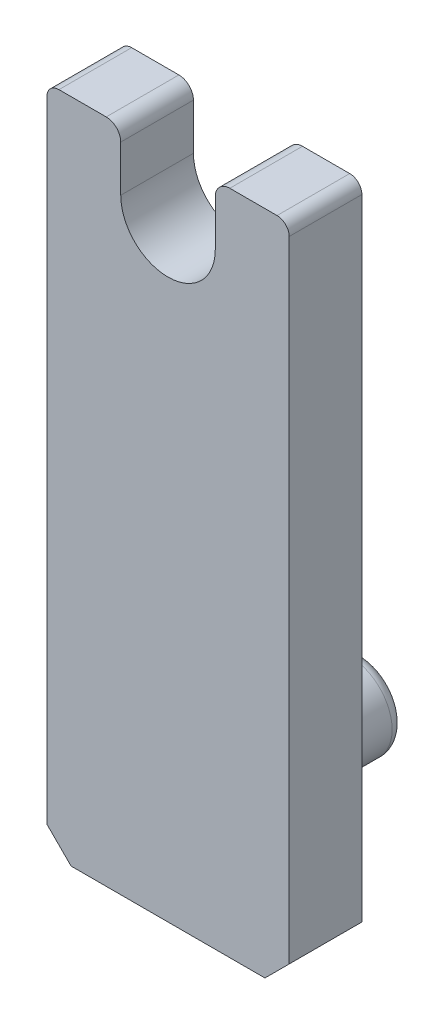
ISO-10303-21;
HEADER;
FILE_DESCRIPTION(('STEP AP214'),'2;1');
FILE_NAME('part.step','',(''),(''),'','','');
FILE_SCHEMA(('AUTOMOTIVE_DESIGN { 1 0 10303 214 1 1 1 1 }'));
ENDSEC;
DATA;
#1=APPLICATION_CONTEXT('core data for automotive mechanical design processes');
#2=APPLICATION_PROTOCOL_DEFINITION('international standard','automotive_design',2000,#1);
#3=PRODUCT_CONTEXT('',#1,'mechanical');
#4=PRODUCT('Part','Part','',(#3));
#5=PRODUCT_RELATED_PRODUCT_CATEGORY('part','',(#4));
#6=PRODUCT_DEFINITION_FORMATION('','',#4);
#7=PRODUCT_DEFINITION_CONTEXT('part definition',#1,'design');
#8=PRODUCT_DEFINITION('design','',#6,#7);
#9=PRODUCT_DEFINITION_SHAPE('','',#8);
#10=(LENGTH_UNIT() NAMED_UNIT(*) SI_UNIT(.MILLI.,.METRE.));
#11=(NAMED_UNIT(*) PLANE_ANGLE_UNIT() SI_UNIT($,.RADIAN.));
#12=(NAMED_UNIT(*) SI_UNIT($,.STERADIAN.) SOLID_ANGLE_UNIT());
#13=UNCERTAINTY_MEASURE_WITH_UNIT(LENGTH_MEASURE(1.E-05),#10,'distance_accuracy_value','');
#14=(GEOMETRIC_REPRESENTATION_CONTEXT(3) GLOBAL_UNCERTAINTY_ASSIGNED_CONTEXT((#13)) GLOBAL_UNIT_ASSIGNED_CONTEXT((#10,
#11,#12)) REPRESENTATION_CONTEXT('',''));
#15=CARTESIAN_POINT('',(0.,0.,0.));
#16=DIRECTION('',(0.,0.,1.));
#17=DIRECTION('',(1.,0.,0.));
#18=AXIS2_PLACEMENT_3D('',#15,#16,#17);
#19=CARTESIAN_POINT('',(-38.8182999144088,37.2047435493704,3.));
#20=DIRECTION('',(1.,0.,0.));
#21=DIRECTION('',(0.,0.,-1.));
#22=AXIS2_PLACEMENT_3D('',#19,#20,#21);
#23=PLANE('',#22);
#24=DIRECTION('',(0.,-1.,0.));
#25=VECTOR('',#24,1.);
#26=CARTESIAN_POINT('',(-38.8182999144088,37.2047435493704,0.));
#27=LINE('',#26,#25);
#28=CARTESIAN_POINT('',(-38.8182999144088,36.7047435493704,0.));
#29=VERTEX_POINT('',#28);
#30=CARTESIAN_POINT('',(-38.8182999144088,10.7047435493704,0.));
#31=VERTEX_POINT('',#30);
#32=EDGE_CURVE('E155',#29,#31,#27,.T.);
#33=ORIENTED_EDGE('',*,*,#32,.T.);
#34=DIRECTION('',(0.,0.,1.));
#35=VECTOR('',#34,1.);
#36=CARTESIAN_POINT('',(-38.8182999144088,10.7047435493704,3.));
#37=LINE('',#36,#35);
#38=CARTESIAN_POINT('',(-38.8182999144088,10.7047435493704,3.));
#39=VERTEX_POINT('',#38);
#40=EDGE_CURVE('E31',#31,#39,#37,.T.);
#41=ORIENTED_EDGE('',*,*,#40,.T.);
#42=DIRECTION('',(0.,-1.,0.));
#43=VECTOR('',#42,1.);
#44=CARTESIAN_POINT('',(-38.8182999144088,37.2047435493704,3.));
#45=LINE('',#44,#43);
#46=CARTESIAN_POINT('',(-38.8182999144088,36.7047435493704,3.));
#47=VERTEX_POINT('',#46);
#48=EDGE_CURVE('E172',#47,#39,#45,.T.);
#49=ORIENTED_EDGE('',*,*,#48,.F.);
#50=DIRECTION('',(0.,0.,-1.));
#51=VECTOR('',#50,1.);
#52=CARTESIAN_POINT('',(-38.8182999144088,36.7047435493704,3.));
#53=LINE('',#52,#51);
#54=EDGE_CURVE('E206',#47,#29,#53,.T.);
#55=ORIENTED_EDGE('',*,*,#54,.T.);
#56=EDGE_LOOP('',(#33,#41,#49,#55));
#57=FACE_BOUND('',#56,.T.);
#58=ADVANCED_FACE('F16',(#57),#23,.F.);
#59=CARTESIAN_POINT('',(-38.8182999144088,9.70474354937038,3.));
#60=DIRECTION('',(0.,1.,0.));
#61=DIRECTION('',(0.,0.,1.));
#62=AXIS2_PLACEMENT_3D('',#59,#60,#61);
#63=PLANE('',#62);
#64=DIRECTION('',(1.,0.,0.));
#65=VECTOR('',#64,1.);
#66=CARTESIAN_POINT('',(-38.8182999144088,9.70474354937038,0.));
#67=LINE('',#66,#65);
#68=CARTESIAN_POINT('',(-37.8182999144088,9.70474354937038,0.));
#69=VERTEX_POINT('',#68);
#70=CARTESIAN_POINT('',(-29.8182999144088,9.70474354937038,0.));
#71=VERTEX_POINT('',#70);
#72=EDGE_CURVE('E157',#69,#71,#67,.T.);
#73=ORIENTED_EDGE('',*,*,#72,.T.);
#74=DIRECTION('',(0.,0.,1.));
#75=VECTOR('',#74,1.);
#76=CARTESIAN_POINT('',(-29.8182999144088,9.70474354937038,3.));
#77=LINE('',#76,#75);
#78=CARTESIAN_POINT('',(-29.8182999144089,9.70474354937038,3.));
#79=VERTEX_POINT('',#78);
#80=EDGE_CURVE('E39',#71,#79,#77,.T.);
#81=ORIENTED_EDGE('',*,*,#80,.T.);
#82=DIRECTION('',(1.,0.,0.));
#83=VECTOR('',#82,1.);
#84=CARTESIAN_POINT('',(-38.8182999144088,9.70474354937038,3.));
#85=LINE('',#84,#83);
#86=CARTESIAN_POINT('',(-37.8182999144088,9.70474354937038,3.));
#87=VERTEX_POINT('',#86);
#88=EDGE_CURVE('E285',#87,#79,#85,.T.);
#89=ORIENTED_EDGE('',*,*,#88,.F.);
#90=DIRECTION('',(0.,0.,-1.));
#91=VECTOR('',#90,1.);
#92=CARTESIAN_POINT('',(-37.8182999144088,9.70474354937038,3.));
#93=LINE('',#92,#91);
#94=EDGE_CURVE('E221',#87,#69,#93,.T.);
#95=ORIENTED_EDGE('',*,*,#94,.T.);
#96=EDGE_LOOP('',(#73,#81,#89,#95));
#97=FACE_BOUND('',#96,.T.);
#98=ADVANCED_FACE('F246',(#97),#63,.F.);
#99=CARTESIAN_POINT('',(-28.8182999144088,37.2047435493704,3.));
#100=DIRECTION('',(-1.,0.,0.));
#101=DIRECTION('',(0.,0.,1.));
#102=AXIS2_PLACEMENT_3D('',#99,#100,#101);
#103=PLANE('',#102);
#104=DIRECTION('',(0.,1.,0.));
#105=VECTOR('',#104,1.);
#106=CARTESIAN_POINT('',(-28.8182999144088,37.2047435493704,3.));
#107=LINE('',#106,#105);
#108=CARTESIAN_POINT('',(-28.8182999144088,10.7047435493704,3.));
#109=VERTEX_POINT('',#108);
#110=CARTESIAN_POINT('',(-28.8182999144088,36.7047435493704,3.));
#111=VERTEX_POINT('',#110);
#112=EDGE_CURVE('E284',#109,#111,#107,.T.);
#113=ORIENTED_EDGE('',*,*,#112,.F.);
#114=DIRECTION('',(0.,0.,-1.));
#115=VECTOR('',#114,1.);
#116=CARTESIAN_POINT('',(-28.8182999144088,10.7047435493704,3.));
#117=LINE('',#116,#115);
#118=CARTESIAN_POINT('',(-28.8182999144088,10.7047435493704,0.));
#119=VERTEX_POINT('',#118);
#120=EDGE_CURVE('E214',#109,#119,#117,.T.);
#121=ORIENTED_EDGE('',*,*,#120,.T.);
#122=DIRECTION('',(0.,1.,0.));
#123=VECTOR('',#122,1.);
#124=CARTESIAN_POINT('',(-28.8182999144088,37.2047435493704,0.));
#125=LINE('',#124,#123);
#126=CARTESIAN_POINT('',(-28.8182999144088,36.7047435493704,0.));
#127=VERTEX_POINT('',#126);
#128=EDGE_CURVE('E159',#119,#127,#125,.T.);
#129=ORIENTED_EDGE('',*,*,#128,.T.);
#130=DIRECTION('',(0.,0.,-1.));
#131=VECTOR('',#130,1.);
#132=CARTESIAN_POINT('',(-28.8182999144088,36.7047435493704,3.));
#133=LINE('',#132,#131);
#134=EDGE_CURVE('E199',#127,#111,#133,.F.);
#135=ORIENTED_EDGE('',*,*,#134,.T.);
#136=EDGE_LOOP('',(#113,#121,#129,#135));
#137=FACE_BOUND('',#136,.T.);
#138=ADVANCED_FACE('F252',(#137),#103,.F.);
#139=CARTESIAN_POINT('',(-31.8682999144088,37.2047435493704,3.));
#140=DIRECTION('',(0.,-1.,0.));
#141=DIRECTION('',(0.,0.,-1.));
#142=AXIS2_PLACEMENT_3D('',#139,#140,#141);
#143=PLANE('',#142);
#144=DIRECTION('',(-1.,0.,0.));
#145=VECTOR('',#144,1.);
#146=CARTESIAN_POINT('',(-31.8682999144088,37.2047435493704,3.));
#147=LINE('',#146,#145);
#148=CARTESIAN_POINT('',(-29.3182999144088,37.2047435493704,3.));
#149=VERTEX_POINT('',#148);
#150=CARTESIAN_POINT('',(-31.2682999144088,37.2047435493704,3.));
#151=VERTEX_POINT('',#150);
#152=EDGE_CURVE('E132',#149,#151,#147,.T.);
#153=ORIENTED_EDGE('',*,*,#152,.F.);
#154=DIRECTION('',(0.,0.,-1.));
#155=VECTOR('',#154,1.);
#156=CARTESIAN_POINT('',(-29.3182999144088,37.2047435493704,3.));
#157=LINE('',#156,#155);
#158=CARTESIAN_POINT('',(-29.3182999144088,37.2047435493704,0.));
#159=VERTEX_POINT('',#158);
#160=EDGE_CURVE('E191',#149,#159,#157,.T.);
#161=ORIENTED_EDGE('',*,*,#160,.T.);
#162=DIRECTION('',(-1.,0.,0.));
#163=VECTOR('',#162,1.);
#164=CARTESIAN_POINT('',(-31.8682999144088,37.2047435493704,0.));
#165=LINE('',#164,#163);
#166=CARTESIAN_POINT('',(-31.2682999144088,37.2047435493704,0.));
#167=VERTEX_POINT('',#166);
#168=EDGE_CURVE('E161',#159,#167,#165,.T.);
#169=ORIENTED_EDGE('',*,*,#168,.T.);
#170=DIRECTION('',(0.,0.,-1.));
#171=VECTOR('',#170,1.);
#172=CARTESIAN_POINT('',(-31.2682999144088,37.2047435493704,3.));
#173=LINE('',#172,#171);
#174=EDGE_CURVE('E180',#167,#151,#173,.F.);
#175=ORIENTED_EDGE('',*,*,#174,.T.);
#176=EDGE_LOOP('',(#153,#161,#169,#175));
#177=FACE_BOUND('',#176,.T.);
#178=ADVANCED_FACE('F304',(#177),#143,.F.);
#179=CARTESIAN_POINT('',(-31.8682999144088,34.7047435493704,3.));
#180=DIRECTION('',(1.,0.,0.));
#181=DIRECTION('',(0.,0.,-1.));
#182=AXIS2_PLACEMENT_3D('',#179,#180,#181);
#183=PLANE('',#182);
#184=DIRECTION('',(0.,-1.,0.));
#185=VECTOR('',#184,1.);
#186=CARTESIAN_POINT('',(-31.8682999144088,34.7047435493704,3.));
#187=LINE('',#186,#185);
#188=CARTESIAN_POINT('',(-31.8682999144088,36.6047435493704,3.));
#189=VERTEX_POINT('',#188);
#190=CARTESIAN_POINT('',(-31.8682999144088,34.7047435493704,3.));
#191=VERTEX_POINT('',#190);
#192=EDGE_CURVE('E120',#189,#191,#187,.T.);
#193=ORIENTED_EDGE('',*,*,#192,.F.);
#194=DIRECTION('',(0.,0.,-1.));
#195=VECTOR('',#194,1.);
#196=CARTESIAN_POINT('',(-31.8682999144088,36.6047435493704,3.));
#197=LINE('',#196,#195);
#198=CARTESIAN_POINT('',(-31.8682999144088,36.6047435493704,0.));
#199=VERTEX_POINT('',#198);
#200=EDGE_CURVE('E141',#189,#199,#197,.T.);
#201=ORIENTED_EDGE('',*,*,#200,.T.);
#202=DIRECTION('',(0.,-1.,0.));
#203=VECTOR('',#202,1.);
#204=CARTESIAN_POINT('',(-31.8682999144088,34.7047435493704,0.));
#205=LINE('',#204,#203);
#206=CARTESIAN_POINT('',(-31.8682999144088,34.7047435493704,0.));
#207=VERTEX_POINT('',#206);
#208=EDGE_CURVE('E138',#199,#207,#205,.T.);
#209=ORIENTED_EDGE('',*,*,#208,.T.);
#210=DIRECTION('',(0.,0.,-1.));
#211=VECTOR('',#210,1.);
#212=CARTESIAN_POINT('',(-31.8682999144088,34.7047435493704,3.));
#213=LINE('',#212,#211);
#214=EDGE_CURVE('E135',#191,#207,#213,.T.);
#215=ORIENTED_EDGE('',*,*,#214,.F.);
#216=EDGE_LOOP('',(#193,#201,#209,#215));
#217=FACE_BOUND('',#216,.T.);
#218=ADVANCED_FACE('F136',(#217),#183,.F.);
#219=CARTESIAN_POINT('',(-33.8182999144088,34.7047435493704,3.));
#220=DIRECTION('',(0.,0.,-1.));
#221=DIRECTION('',(-1.,0.,0.));
#222=AXIS2_PLACEMENT_3D('',#219,#220,#221);
#223=CYLINDRICAL_SURFACE('',#222,1.95);
#224=CARTESIAN_POINT('',(-33.8182999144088,34.7047435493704,0.));
#225=DIRECTION('',(0.,0.,-1.));
#226=DIRECTION('',(1.,0.,0.));
#227=AXIS2_PLACEMENT_3D('',#224,#225,#226);
#228=CIRCLE('',#227,1.95);
#229=CARTESIAN_POINT('',(-35.7682999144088,34.7047435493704,0.));
#230=VERTEX_POINT('',#229);
#231=EDGE_CURVE('E164',#207,#230,#228,.T.);
#232=ORIENTED_EDGE('',*,*,#231,.T.);
#233=DIRECTION('',(0.,0.,-1.));
#234=VECTOR('',#233,1.);
#235=CARTESIAN_POINT('',(-35.7682999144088,34.7047435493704,3.));
#236=LINE('',#235,#234);
#237=CARTESIAN_POINT('',(-35.7682999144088,34.7047435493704,3.));
#238=VERTEX_POINT('',#237);
#239=EDGE_CURVE('E142',#238,#230,#236,.T.);
#240=ORIENTED_EDGE('',*,*,#239,.F.);
#241=CARTESIAN_POINT('',(-33.8182999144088,34.7047435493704,3.));
#242=DIRECTION('',(0.,0.,-1.));
#243=DIRECTION('',(1.,0.,0.));
#244=AXIS2_PLACEMENT_3D('',#241,#242,#243);
#245=CIRCLE('',#244,1.95);
#246=EDGE_CURVE('E125',#191,#238,#245,.T.);
#247=ORIENTED_EDGE('',*,*,#246,.F.);
#248=ORIENTED_EDGE('',*,*,#214,.T.);
#249=EDGE_LOOP('',(#232,#240,#247,#248));
#250=FACE_BOUND('',#249,.T.);
#251=ADVANCED_FACE('F144',(#250),#223,.F.);
#252=CARTESIAN_POINT('',(-35.7682999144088,34.7047435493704,3.));
#253=DIRECTION('',(-1.,0.,0.));
#254=DIRECTION('',(0.,0.,1.));
#255=AXIS2_PLACEMENT_3D('',#252,#253,#254);
#256=PLANE('',#255);
#257=DIRECTION('',(0.,1.,0.));
#258=VECTOR('',#257,1.);
#259=CARTESIAN_POINT('',(-35.7682999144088,34.7047435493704,0.));
#260=LINE('',#259,#258);
#261=CARTESIAN_POINT('',(-35.7682999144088,36.6047435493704,0.));
#262=VERTEX_POINT('',#261);
#263=EDGE_CURVE('E166',#230,#262,#260,.T.);
#264=ORIENTED_EDGE('',*,*,#263,.T.);
#265=DIRECTION('',(0.,0.,-1.));
#266=VECTOR('',#265,1.);
#267=CARTESIAN_POINT('',(-35.7682999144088,36.6047435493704,3.));
#268=LINE('',#267,#266);
#269=CARTESIAN_POINT('',(-35.7682999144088,36.6047435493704,3.));
#270=VERTEX_POINT('',#269);
#271=EDGE_CURVE('E189',#262,#270,#268,.F.);
#272=ORIENTED_EDGE('',*,*,#271,.T.);
#273=DIRECTION('',(0.,1.,0.));
#274=VECTOR('',#273,1.);
#275=CARTESIAN_POINT('',(-35.7682999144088,34.7047435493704,3.));
#276=LINE('',#275,#274);
#277=EDGE_CURVE('E147',#238,#270,#276,.T.);
#278=ORIENTED_EDGE('',*,*,#277,.F.);
#279=ORIENTED_EDGE('',*,*,#239,.T.);
#280=EDGE_LOOP('',(#264,#272,#278,#279));
#281=FACE_BOUND('',#280,.T.);
#282=ADVANCED_FACE('F308',(#281),#256,.F.);
#283=CARTESIAN_POINT('',(-38.8182999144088,37.2047435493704,3.));
#284=DIRECTION('',(0.,-1.,0.));
#285=DIRECTION('',(0.,0.,-1.));
#286=AXIS2_PLACEMENT_3D('',#283,#284,#285);
#287=PLANE('',#286);
#288=DIRECTION('',(-1.,0.,0.));
#289=VECTOR('',#288,1.);
#290=CARTESIAN_POINT('',(-38.8182999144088,37.2047435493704,0.));
#291=LINE('',#290,#289);
#292=CARTESIAN_POINT('',(-36.3682999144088,37.2047435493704,0.));
#293=VERTEX_POINT('',#292);
#294=CARTESIAN_POINT('',(-38.3182999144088,37.2047435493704,0.));
#295=VERTEX_POINT('',#294);
#296=EDGE_CURVE('E169',#293,#295,#291,.T.);
#297=ORIENTED_EDGE('',*,*,#296,.T.);
#298=DIRECTION('',(0.,0.,-1.));
#299=VECTOR('',#298,1.);
#300=CARTESIAN_POINT('',(-38.3182999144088,37.2047435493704,3.));
#301=LINE('',#300,#299);
#302=CARTESIAN_POINT('',(-38.3182999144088,37.2047435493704,3.));
#303=VERTEX_POINT('',#302);
#304=EDGE_CURVE('E209',#295,#303,#301,.F.);
#305=ORIENTED_EDGE('',*,*,#304,.T.);
#306=DIRECTION('',(-1.,0.,0.));
#307=VECTOR('',#306,1.);
#308=CARTESIAN_POINT('',(-38.8182999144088,37.2047435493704,3.));
#309=LINE('',#308,#307);
#310=CARTESIAN_POINT('',(-36.3682999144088,37.2047435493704,3.));
#311=VERTEX_POINT('',#310);
#312=EDGE_CURVE('E149',#311,#303,#309,.T.);
#313=ORIENTED_EDGE('',*,*,#312,.F.);
#314=DIRECTION('',(0.,0.,-1.));
#315=VECTOR('',#314,1.);
#316=CARTESIAN_POINT('',(-36.3682999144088,37.2047435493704,3.));
#317=LINE('',#316,#315);
#318=EDGE_CURVE('E186',#311,#293,#317,.T.);
#319=ORIENTED_EDGE('',*,*,#318,.T.);
#320=EDGE_LOOP('',(#297,#305,#313,#319));
#321=FACE_BOUND('',#320,.T.);
#322=ADVANCED_FACE('F315',(#321),#287,.F.);
#323=CARTESIAN_POINT('',(-33.8182999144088,34.7047435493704,3.));
#324=DIRECTION('',(0.,0.,1.));
#325=DIRECTION('',(1.,0.,0.));
#326=AXIS2_PLACEMENT_3D('',#323,#324,#325);
#327=PLANE('',#326);
#328=ORIENTED_EDGE('',*,*,#88,.T.);
#329=DIRECTION('',(-0.707106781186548,-0.707106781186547,0.));
#330=VECTOR('',#329,1.);
#331=CARTESIAN_POINT('',(-19.3182999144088,20.2047435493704,3.));
#332=LINE('',#331,#330);
#333=EDGE_CURVE('E227',#79,#109,#332,.F.);
#334=ORIENTED_EDGE('',*,*,#333,.T.);
#335=ORIENTED_EDGE('',*,*,#112,.T.);
#336=CARTESIAN_POINT('',(-29.3182999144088,36.7047435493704,3.));
#337=DIRECTION('',(0.,0.,1.));
#338=DIRECTION('',(1.,0.,0.));
#339=AXIS2_PLACEMENT_3D('',#336,#337,#338);
#340=CIRCLE('',#339,0.5);
#341=EDGE_CURVE('E204',#111,#149,#340,.T.);
#342=ORIENTED_EDGE('',*,*,#341,.T.);
#343=ORIENTED_EDGE('',*,*,#152,.T.);
#344=CARTESIAN_POINT('',(-31.2682999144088,36.6047435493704,3.));
#345=DIRECTION('',(0.,0.,1.));
#346=DIRECTION('',(1.,0.,0.));
#347=AXIS2_PLACEMENT_3D('',#344,#345,#346);
#348=CIRCLE('',#347,0.6);
#349=EDGE_CURVE('E128',#151,#189,#348,.T.);
#350=ORIENTED_EDGE('',*,*,#349,.T.);
#351=ORIENTED_EDGE('',*,*,#192,.T.);
#352=ORIENTED_EDGE('',*,*,#246,.T.);
#353=ORIENTED_EDGE('',*,*,#277,.T.);
#354=CARTESIAN_POINT('',(-36.3682999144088,36.6047435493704,3.));
#355=DIRECTION('',(0.,0.,1.));
#356=DIRECTION('',(1.,0.,0.));
#357=AXIS2_PLACEMENT_3D('',#354,#355,#356);
#358=CIRCLE('',#357,0.6);
#359=EDGE_CURVE('E183',#270,#311,#358,.T.);
#360=ORIENTED_EDGE('',*,*,#359,.T.);
#361=ORIENTED_EDGE('',*,*,#312,.T.);
#362=CARTESIAN_POINT('',(-38.3182999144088,36.7047435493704,3.));
#363=DIRECTION('',(0.,0.,1.));
#364=DIRECTION('',(1.,0.,0.));
#365=AXIS2_PLACEMENT_3D('',#362,#363,#364);
#366=CIRCLE('',#365,0.5);
#367=EDGE_CURVE('E202',#303,#47,#366,.T.);
#368=ORIENTED_EDGE('',*,*,#367,.T.);
#369=ORIENTED_EDGE('',*,*,#48,.T.);
#370=DIRECTION('',(-0.707106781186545,0.707106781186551,0.));
#371=VECTOR('',#370,1.);
#372=CARTESIAN_POINT('',(-48.3182999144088,20.2047435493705,3.));
#373=LINE('',#372,#371);
#374=EDGE_CURVE('E225',#39,#87,#373,.F.);
#375=ORIENTED_EDGE('',*,*,#374,.T.);
#376=EDGE_LOOP('',(#328,#334,#335,#342,#343,#350,#351,#352,#353,#360,#361,#368,#369,#375));
#377=FACE_BOUND('',#376,.T.);
#378=ADVANCED_FACE('F122',(#377),#327,.T.);
#379=CARTESIAN_POINT('',(-33.8182999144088,34.7047435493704,0.));
#380=DIRECTION('',(0.,0.,1.));
#381=DIRECTION('',(1.,0.,0.));
#382=AXIS2_PLACEMENT_3D('',#379,#380,#381);
#383=PLANE('',#382);
#384=CARTESIAN_POINT('',(-33.8182999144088,13.7047435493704,0.));
#385=DIRECTION('',(0.,0.,1.));
#386=DIRECTION('',(1.,0.,0.));
#387=AXIS2_PLACEMENT_3D('',#384,#385,#386);
#388=CIRCLE('',#387,1.75);
#389=CARTESIAN_POINT('',(-32.0682999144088,13.7047435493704,0.));
#390=VERTEX_POINT('',#389);
#391=EDGE_CURVE('E211',#390,#390,#388,.F.);
#392=ORIENTED_EDGE('',*,*,#391,.F.);
#393=EDGE_LOOP('',(#392));
#394=FACE_BOUND('',#393,.T.);
#395=ORIENTED_EDGE('',*,*,#128,.F.);
#396=DIRECTION('',(0.707106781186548,0.707106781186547,0.));
#397=VECTOR('',#396,1.);
#398=CARTESIAN_POINT('',(-28.8182999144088,10.7047435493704,0.));
#399=LINE('',#398,#397);
#400=EDGE_CURVE('E219',#119,#71,#399,.F.);
#401=ORIENTED_EDGE('',*,*,#400,.T.);
#402=ORIENTED_EDGE('',*,*,#72,.F.);
#403=DIRECTION('',(0.707106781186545,-0.707106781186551,0.));
#404=VECTOR('',#403,1.);
#405=CARTESIAN_POINT('',(-37.8182999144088,9.70474354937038,0.));
#406=LINE('',#405,#404);
#407=EDGE_CURVE('E217',#69,#31,#406,.F.);
#408=ORIENTED_EDGE('',*,*,#407,.T.);
#409=ORIENTED_EDGE('',*,*,#32,.F.);
#410=CARTESIAN_POINT('',(-38.3182999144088,36.7047435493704,0.));
#411=DIRECTION('',(0.,0.,1.));
#412=DIRECTION('',(1.,0.,0.));
#413=AXIS2_PLACEMENT_3D('',#410,#411,#412);
#414=CIRCLE('',#413,0.5);
#415=EDGE_CURVE('E194',#29,#295,#414,.F.);
#416=ORIENTED_EDGE('',*,*,#415,.T.);
#417=ORIENTED_EDGE('',*,*,#296,.F.);
#418=CARTESIAN_POINT('',(-36.3682999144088,36.6047435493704,0.));
#419=DIRECTION('',(0.,0.,1.));
#420=DIRECTION('',(1.,0.,0.));
#421=AXIS2_PLACEMENT_3D('',#418,#419,#420);
#422=CIRCLE('',#421,0.6);
#423=EDGE_CURVE('E175',#293,#262,#422,.F.);
#424=ORIENTED_EDGE('',*,*,#423,.T.);
#425=ORIENTED_EDGE('',*,*,#263,.F.);
#426=ORIENTED_EDGE('',*,*,#231,.F.);
#427=ORIENTED_EDGE('',*,*,#208,.F.);
#428=CARTESIAN_POINT('',(-31.2682999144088,36.6047435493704,0.));
#429=DIRECTION('',(0.,0.,1.));
#430=DIRECTION('',(1.,0.,0.));
#431=AXIS2_PLACEMENT_3D('',#428,#429,#430);
#432=CIRCLE('',#431,0.6);
#433=EDGE_CURVE('E177',#199,#167,#432,.F.);
#434=ORIENTED_EDGE('',*,*,#433,.T.);
#435=ORIENTED_EDGE('',*,*,#168,.F.);
#436=CARTESIAN_POINT('',(-29.3182999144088,36.7047435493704,0.));
#437=DIRECTION('',(0.,0.,1.));
#438=DIRECTION('',(1.,0.,0.));
#439=AXIS2_PLACEMENT_3D('',#436,#437,#438);
#440=CIRCLE('',#439,0.5);
#441=EDGE_CURVE('E196',#159,#127,#440,.F.);
#442=ORIENTED_EDGE('',*,*,#441,.T.);
#443=EDGE_LOOP('',(#395,#401,#402,#408,#409,#416,#417,#424,#425,#426,#427,#434,#435,#442));
#444=FACE_BOUND('',#443,.T.);
#445=ADVANCED_FACE('F260',(#394,#444),#383,.F.);
#446=CARTESIAN_POINT('',(-31.2682999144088,36.6047435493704,3.));
#447=DIRECTION('',(0.,0.,-1.));
#448=DIRECTION('',(-1.,0.,0.));
#449=AXIS2_PLACEMENT_3D('',#446,#447,#448);
#450=CYLINDRICAL_SURFACE('',#449,0.6);
#451=ORIENTED_EDGE('',*,*,#349,.F.);
#452=ORIENTED_EDGE('',*,*,#174,.F.);
#453=ORIENTED_EDGE('',*,*,#433,.F.);
#454=ORIENTED_EDGE('',*,*,#200,.F.);
#455=EDGE_LOOP('',(#451,#452,#453,#454));
#456=FACE_BOUND('',#455,.T.);
#457=ADVANCED_FACE('F256',(#456),#450,.T.);
#458=CARTESIAN_POINT('',(-36.3682999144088,36.6047435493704,3.));
#459=DIRECTION('',(0.,0.,-1.));
#460=DIRECTION('',(-1.,0.,0.));
#461=AXIS2_PLACEMENT_3D('',#458,#459,#460);
#462=CYLINDRICAL_SURFACE('',#461,0.6);
#463=ORIENTED_EDGE('',*,*,#359,.F.);
#464=ORIENTED_EDGE('',*,*,#271,.F.);
#465=ORIENTED_EDGE('',*,*,#423,.F.);
#466=ORIENTED_EDGE('',*,*,#318,.F.);
#467=EDGE_LOOP('',(#463,#464,#465,#466));
#468=FACE_BOUND('',#467,.T.);
#469=ADVANCED_FACE('F259',(#468),#462,.T.);
#470=CARTESIAN_POINT('',(-29.3182999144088,36.7047435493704,3.));
#471=DIRECTION('',(0.,0.,-1.));
#472=DIRECTION('',(-1.,0.,0.));
#473=AXIS2_PLACEMENT_3D('',#470,#471,#472);
#474=CYLINDRICAL_SURFACE('',#473,0.5);
#475=ORIENTED_EDGE('',*,*,#341,.F.);
#476=ORIENTED_EDGE('',*,*,#134,.F.);
#477=ORIENTED_EDGE('',*,*,#441,.F.);
#478=ORIENTED_EDGE('',*,*,#160,.F.);
#479=EDGE_LOOP('',(#475,#476,#477,#478));
#480=FACE_BOUND('',#479,.T.);
#481=ADVANCED_FACE('F264',(#480),#474,.T.);
#482=CARTESIAN_POINT('',(-38.3182999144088,36.7047435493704,3.));
#483=DIRECTION('',(0.,0.,-1.));
#484=DIRECTION('',(-1.,0.,0.));
#485=AXIS2_PLACEMENT_3D('',#482,#483,#484);
#486=CYLINDRICAL_SURFACE('',#485,0.5);
#487=ORIENTED_EDGE('',*,*,#367,.F.);
#488=ORIENTED_EDGE('',*,*,#304,.F.);
#489=ORIENTED_EDGE('',*,*,#415,.F.);
#490=ORIENTED_EDGE('',*,*,#54,.F.);
#491=EDGE_LOOP('',(#487,#488,#489,#490));
#492=FACE_BOUND('',#491,.T.);
#493=ADVANCED_FACE('F268',(#492),#486,.T.);
#494=CARTESIAN_POINT('',(-33.8182999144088,13.7047435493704,-5.));
#495=DIRECTION('',(0.,0.,1.));
#496=DIRECTION('',(1.,0.,0.));
#497=AXIS2_PLACEMENT_3D('',#494,#495,#496);
#498=CYLINDRICAL_SURFACE('',#497,1.75);
#499=CARTESIAN_POINT('',(-33.8182999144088,13.7047435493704,-4.5));
#500=DIRECTION('',(0.,0.,-1.));
#501=DIRECTION('',(-1.,0.,0.));
#502=AXIS2_PLACEMENT_3D('',#499,#500,#501);
#503=CIRCLE('',#502,1.75);
#504=CARTESIAN_POINT('',(-35.5682999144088,13.7047435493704,-4.5));
#505=VERTEX_POINT('',#504);
#506=EDGE_CURVE('E11',#505,#505,#503,.F.);
#507=ORIENTED_EDGE('',*,*,#506,.T.);
#508=EDGE_LOOP('',(#507));
#509=FACE_BOUND('',#508,.T.);
#510=ORIENTED_EDGE('',*,*,#391,.T.);
#511=EDGE_LOOP('',(#510));
#512=FACE_BOUND('',#511,.T.);
#513=ADVANCED_FACE('F272',(#509,#512),#498,.T.);
#514=CARTESIAN_POINT('',(-33.8182999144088,13.7047435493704,-5.));
#515=DIRECTION('',(0.,0.,-1.));
#516=DIRECTION('',(-1.,0.,0.));
#517=AXIS2_PLACEMENT_3D('',#514,#515,#516);
#518=PLANE('',#517);
#519=CARTESIAN_POINT('',(-33.8182999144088,13.7047435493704,-5.));
#520=DIRECTION('',(0.,0.,-1.));
#521=DIRECTION('',(-1.,0.,0.));
#522=AXIS2_PLACEMENT_3D('',#519,#520,#521);
#523=CIRCLE('',#522,1.25);
#524=CARTESIAN_POINT('',(-35.0682999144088,13.7047435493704,-5.));
#525=VERTEX_POINT('',#524);
#526=EDGE_CURVE('E24',#525,#525,#523,.T.);
#527=ORIENTED_EDGE('',*,*,#526,.T.);
#528=EDGE_LOOP('',(#527));
#529=FACE_BOUND('',#528,.T.);
#530=ADVANCED_FACE('F232',(#529),#518,.T.);
#531=CARTESIAN_POINT('',(-28.8182999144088,10.7047435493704,3.));
#532=DIRECTION('',(-0.707106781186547,0.707106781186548,0.));
#533=DIRECTION('',(-0.707106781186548,-0.707106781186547,0.));
#534=AXIS2_PLACEMENT_3D('',#531,#532,#533);
#535=PLANE('',#534);
#536=ORIENTED_EDGE('',*,*,#333,.F.);
#537=ORIENTED_EDGE('',*,*,#80,.F.);
#538=ORIENTED_EDGE('',*,*,#400,.F.);
#539=ORIENTED_EDGE('',*,*,#120,.F.);
#540=EDGE_LOOP('',(#536,#537,#538,#539));
#541=FACE_BOUND('',#540,.T.);
#542=ADVANCED_FACE('F242',(#541),#535,.F.);
#543=CARTESIAN_POINT('',(-37.8182999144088,9.70474354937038,3.));
#544=DIRECTION('',(0.707106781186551,0.707106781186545,0.));
#545=DIRECTION('',(-0.707106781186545,0.707106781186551,0.));
#546=AXIS2_PLACEMENT_3D('',#543,#544,#545);
#547=PLANE('',#546);
#548=ORIENTED_EDGE('',*,*,#374,.F.);
#549=ORIENTED_EDGE('',*,*,#40,.F.);
#550=ORIENTED_EDGE('',*,*,#407,.F.);
#551=ORIENTED_EDGE('',*,*,#94,.F.);
#552=EDGE_LOOP('',(#548,#549,#550,#551));
#553=FACE_BOUND('',#552,.T.);
#554=ADVANCED_FACE('F235',(#553),#547,.F.);
#555=CARTESIAN_POINT('',(-33.8182999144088,13.7047435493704,-4.5));
#556=DIRECTION('',(0.,0.,-1.));
#557=DIRECTION('',(-1.,0.,0.));
#558=AXIS2_PLACEMENT_3D('',#555,#556,#557);
#559=TOROIDAL_SURFACE('',#558,1.25,0.5);
#560=ORIENTED_EDGE('',*,*,#506,.F.);
#561=EDGE_LOOP('',(#560));
#562=FACE_BOUND('',#561,.T.);
#563=ORIENTED_EDGE('',*,*,#526,.F.);
#564=EDGE_LOOP('',(#563));
#565=FACE_BOUND('',#564,.T.);
#566=ADVANCED_FACE('F18',(#562,#565),#559,.T.);
#567=CLOSED_SHELL('',(#58,#98,#138,#178,#218,#251,#282,#322,#378,#445,#457,#469,#481,#493,#513,
#530,#542,#554,#566));
#568=MANIFOLD_SOLID_BREP('B1',#567);
#569=ADVANCED_BREP_SHAPE_REPRESENTATION('',(#18,#568),#14);
#570=SHAPE_DEFINITION_REPRESENTATION(#9,#569);
ENDSEC;
END-ISO-10303-21;
